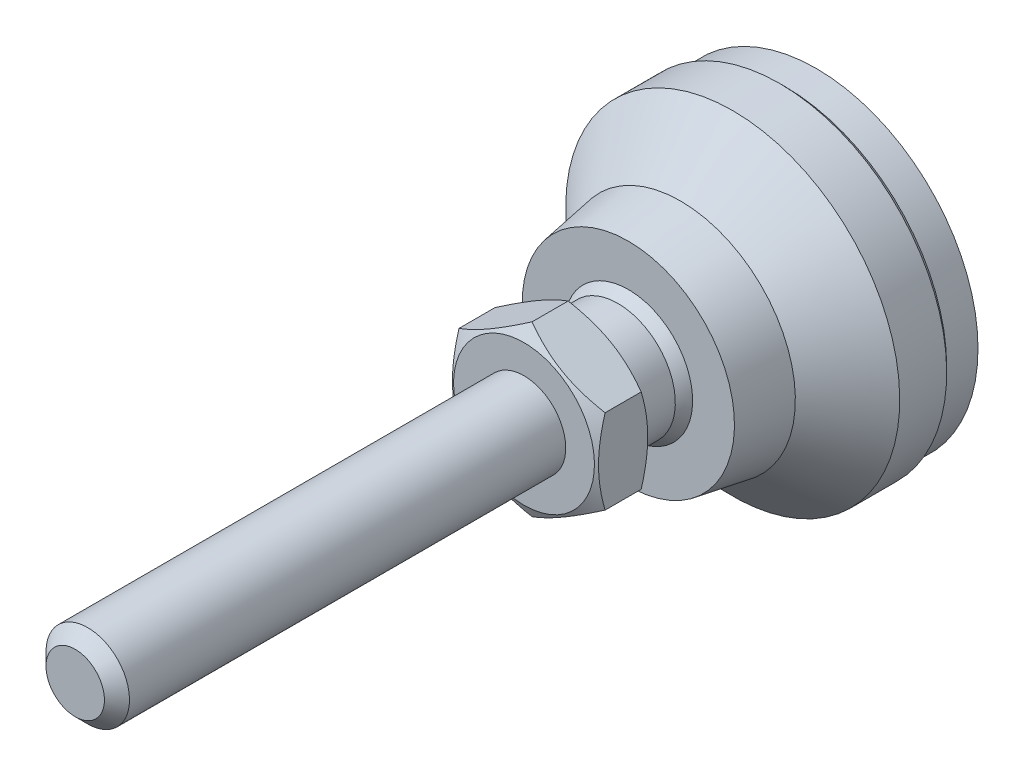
ISO-10303-21;
HEADER;
FILE_DESCRIPTION(('STEP AP214'),'2;1');
FILE_NAME('part.step','',(''),(''),'','','');
FILE_SCHEMA(('AUTOMOTIVE_DESIGN { 1 0 10303 214 1 1 1 1 }'));
ENDSEC;
DATA;
#1=APPLICATION_CONTEXT('core data for automotive mechanical design processes');
#2=APPLICATION_PROTOCOL_DEFINITION('international standard','automotive_design',2000,#1);
#3=PRODUCT_CONTEXT('',#1,'mechanical');
#4=PRODUCT('Part','Part','',(#3));
#5=PRODUCT_RELATED_PRODUCT_CATEGORY('part','',(#4));
#6=PRODUCT_DEFINITION_FORMATION('','',#4);
#7=PRODUCT_DEFINITION_CONTEXT('part definition',#1,'design');
#8=PRODUCT_DEFINITION('design','',#6,#7);
#9=PRODUCT_DEFINITION_SHAPE('','',#8);
#10=(LENGTH_UNIT() NAMED_UNIT(*) SI_UNIT(.MILLI.,.METRE.));
#11=(NAMED_UNIT(*) PLANE_ANGLE_UNIT() SI_UNIT($,.RADIAN.));
#12=(NAMED_UNIT(*) SI_UNIT($,.STERADIAN.) SOLID_ANGLE_UNIT());
#13=UNCERTAINTY_MEASURE_WITH_UNIT(LENGTH_MEASURE(1.E-05),#10,'distance_accuracy_value','');
#14=(GEOMETRIC_REPRESENTATION_CONTEXT(3) GLOBAL_UNCERTAINTY_ASSIGNED_CONTEXT((#13)) GLOBAL_UNIT_ASSIGNED_CONTEXT((#10,
#11,#12)) REPRESENTATION_CONTEXT('',''));
#15=CARTESIAN_POINT('',(0.,0.,0.));
#16=DIRECTION('',(0.,0.,1.));
#17=DIRECTION('',(1.,0.,0.));
#18=AXIS2_PLACEMENT_3D('',#15,#16,#17);
#19=CARTESIAN_POINT('',(0.,0.,2.99999999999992));
#20=DIRECTION('',(0.,0.,-1.));
#21=DIRECTION('',(0.,1.,0.));
#22=AXIS2_PLACEMENT_3D('',#19,#20,#21);
#23=CYLINDRICAL_SURFACE('',#22,5.49999999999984);
#24=CARTESIAN_POINT('',(0.,0.,23.));
#25=DIRECTION('',(0.,0.,-1.));
#26=DIRECTION('',(0.,1.,0.));
#27=AXIS2_PLACEMENT_3D('',#24,#25,#26);
#28=CIRCLE('',#27,5.49999999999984);
#29=CARTESIAN_POINT('',(0.,5.49999999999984,23.));
#30=VERTEX_POINT('',#29);
#31=EDGE_CURVE('E111',#30,#30,#28,.T.);
#32=ORIENTED_EDGE('',*,*,#31,.T.);
#33=EDGE_LOOP('',(#32));
#34=FACE_BOUND('',#33,.T.);
#35=CARTESIAN_POINT('',(0.,0.,19.));
#36=DIRECTION('',(0.,0.,1.));
#37=DIRECTION('',(0.,-1.,0.));
#38=AXIS2_PLACEMENT_3D('',#35,#36,#37);
#39=CIRCLE('',#38,5.49999999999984);
#40=CARTESIAN_POINT('',(-5.50000000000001,0.,19.));
#41=VERTEX_POINT('',#40);
#42=EDGE_CURVE('E113',#41,#41,#39,.T.);
#43=ORIENTED_EDGE('',*,*,#42,.T.);
#44=EDGE_LOOP('',(#43));
#45=FACE_BOUND('',#44,.T.);
#46=ADVANCED_FACE('F14',(#34,#45),#23,.T.);
#47=CARTESIAN_POINT('',(0.,0.,14.6698729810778));
#48=DIRECTION('',(0.,0.,1.));
#49=DIRECTION('',(-1.,0.,0.));
#50=AXIS2_PLACEMENT_3D('',#47,#48,#49);
#51=SPHERICAL_SURFACE('',#50,7.);
#52=CARTESIAN_POINT('',(0.,0.,18.));
#53=DIRECTION('',(0.,0.,1.));
#54=DIRECTION('',(0.,-1.,0.));
#55=AXIS2_PLACEMENT_3D('',#52,#53,#54);
#56=CIRCLE('',#55,6.15713034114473);
#57=CARTESIAN_POINT('',(-6.15713034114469,0.,18.));
#58=VERTEX_POINT('',#57);
#59=EDGE_CURVE('E118',#58,#58,#56,.T.);
#60=CARTESIAN_POINT('',(-5.50000000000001,0.,19.));
#61=CARTESIAN_POINT('',(-5.50771979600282,0.,18.9901945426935));
#62=CARTESIAN_POINT('',(-5.51541336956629,0.,18.9803684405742));
#63=CARTESIAN_POINT('',(-5.530747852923,0.,18.9606752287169));
#64=CARTESIAN_POINT('',(-5.53838876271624,0.,18.950808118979));
#65=CARTESIAN_POINT('',(-5.55361769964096,0.,18.9310331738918));
#66=CARTESIAN_POINT('',(-5.56120572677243,0.,18.9211253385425));
#67=CARTESIAN_POINT('',(-5.57632868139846,0.,18.901269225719));
#68=CARTESIAN_POINT('',(-5.58386360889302,0.,18.8913209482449));
#69=CARTESIAN_POINT('',(-5.59888014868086,0.,18.8713842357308));
#70=CARTESIAN_POINT('',(-5.60636176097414,0.,18.8613958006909));
#71=CARTESIAN_POINT('',(-5.62127145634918,0.,18.8413790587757));
#72=CARTESIAN_POINT('',(-5.62869953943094,0.,18.8313507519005));
#73=CARTESIAN_POINT('',(-5.64350196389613,0.,18.8112545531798));
#74=CARTESIAN_POINT('',(-5.65087630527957,0.,18.8011866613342));
#75=CARTESIAN_POINT('',(-5.66557103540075,0.,18.7810115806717));
#76=CARTESIAN_POINT('',(-5.67289142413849,0.,18.7709043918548));
#77=CARTESIAN_POINT('',(-5.68747803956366,0.,18.7506510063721));
#78=CARTESIAN_POINT('',(-5.69474426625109,0.,18.7405048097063));
#79=CARTESIAN_POINT('',(-5.70922234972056,0.,18.7201736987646));
#80=CARTESIAN_POINT('',(-5.7164342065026,0.,18.7099887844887));
#81=CARTESIAN_POINT('',(-5.73080334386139,0.,18.6895805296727));
#82=CARTESIAN_POINT('',(-5.73796062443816,0.,18.6793571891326));
#83=CARTESIAN_POINT('',(-5.75222040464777,0.,18.6588723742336));
#84=CARTESIAN_POINT('',(-5.75932290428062,0.,18.6486108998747));
#85=CARTESIAN_POINT('',(-5.77347291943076,0.,18.6280501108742));
#86=CARTESIAN_POINT('',(-5.78052043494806,0.,18.6177507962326));
#87=CARTESIAN_POINT('',(-5.79456028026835,0.,18.5971146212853));
#88=CARTESIAN_POINT('',(-5.80155261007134,0.,18.5867777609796));
#89=CARTESIAN_POINT('',(-5.81548188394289,0.,18.5660667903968));
#90=CARTESIAN_POINT('',(-5.82241882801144,0.,18.5556926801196));
#91=CARTESIAN_POINT('',(-5.8362371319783,0.,18.5349075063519));
#92=CARTESIAN_POINT('',(-5.84311849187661,0.,18.5244964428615));
#93=CARTESIAN_POINT('',(-5.85682543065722,0.,18.5036376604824));
#94=CARTESIAN_POINT('',(-5.86365100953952,0.,18.4931899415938));
#95=CARTESIAN_POINT('',(-5.87724619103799,0.,18.4722581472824));
#96=CARTESIAN_POINT('',(-5.88401579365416,0.,18.4617740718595));
#97=CARTESIAN_POINT('',(-5.89749882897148,0.,18.4407698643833));
#98=CARTESIAN_POINT('',(-5.90421226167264,0.,18.43024973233));
#99=CARTESIAN_POINT('',(-5.91758276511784,0.,18.409173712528));
#100=CARTESIAN_POINT('',(-5.92423983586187,0.,18.3986178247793));
#101=CARTESIAN_POINT('',(-5.93749742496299,0.,18.3774705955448));
#102=CARTESIAN_POINT('',(-5.94409794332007,0.,18.3668792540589));
#103=CARTESIAN_POINT('',(-5.95724223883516,0.,18.345661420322));
#104=CARTESIAN_POINT('',(-5.96378601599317,0.,18.3350349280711));
#105=CARTESIAN_POINT('',(-5.97681664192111,0.,18.3137470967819));
#106=CARTESIAN_POINT('',(-5.98330349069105,0.,18.3030857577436));
#107=CARTESIAN_POINT('',(-5.99622007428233,0.,18.2817285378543));
#108=CARTESIAN_POINT('',(-6.00264980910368,0.,18.2710326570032));
#109=CARTESIAN_POINT('',(-6.015451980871,0.,18.2496066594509));
#110=CARTESIAN_POINT('',(-6.02182441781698,0.,18.2388765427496));
#111=CARTESIAN_POINT('',(-6.034511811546,0.,18.2173823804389));
#112=CARTESIAN_POINT('',(-6.04082676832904,0.,18.2066183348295));
#113=CARTESIAN_POINT('',(-6.05339902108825,0.,18.1850566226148));
#114=CARTESIAN_POINT('',(-6.05965631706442,0.,18.1742589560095));
#115=CARTESIAN_POINT('',(-6.07211306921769,0.,18.1526303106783));
#116=CARTESIAN_POINT('',(-6.0783125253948,0.,18.1417993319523));
#117=CARTESIAN_POINT('',(-6.09065342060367,0.,18.1201043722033));
#118=CARTESIAN_POINT('',(-6.09679485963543,0.,18.1092403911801));
#119=CARTESIAN_POINT('',(-6.10901954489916,0.,18.0874797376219));
#120=CARTESIAN_POINT('',(-6.11510279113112,0.,18.0765830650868));
#121=CARTESIAN_POINT('',(-6.12721091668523,0.,18.0547573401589));
#122=CARTESIAN_POINT('',(-6.13323579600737,0.,18.0438282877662));
#123=CARTESIAN_POINT('',(-6.14522701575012,0.,18.0219381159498));
#124=CARTESIAN_POINT('',(-6.15119335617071,0.,18.010976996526));
#125=CARTESIAN_POINT('',(-6.15713034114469,0.,18.));
#126=B_SPLINE_CURVE_WITH_KNOTS('',3,(#60,#61,#62,#63,#64,#65,#66,#67,#68,#69,#70,#71,#72,#73,
#74,#75,#76,#77,#78,#79,#80,#81,#82,#83,#84,#85,#86,#87,#88,#89,#90,#91,#92,#93,#94,#95,#96,#97,
#98,#99,#100,#101,#102,#103,#104,#105,#106,#107,#108,#109,#110,#111,#112,#113,#114,#115,#116,
#117,#118,#119,#120,#121,#122,#123,#124,#125),.UNSPECIFIED.,.F.,.F.,(4,2,2,2,2,2,2,2,2,2,2,2,2,
2,2,2,2,2,2,2,2,2,2,2,2,2,2,2,2,2,2,2,4),(0.,0.0374389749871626,0.0748779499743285,
0.112316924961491,0.149755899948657,0.18719487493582,0.224633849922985,0.262072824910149,
0.299511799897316,0.336950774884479,0.374389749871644,0.411828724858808,0.449267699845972,
0.486706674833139,0.524145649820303,0.561584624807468,0.599023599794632,0.636462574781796,
0.673901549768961,0.711340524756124,0.74877949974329,0.786218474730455,0.823657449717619,
0.861096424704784,0.898535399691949,0.935974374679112,0.973413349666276,1.01085232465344,
1.04829129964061,1.08573027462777,1.12316924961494,1.1606082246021,1.19804719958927),.UNSPECIFIED.);
#127=EDGE_CURVE('BSEAM157',#41,#58,#126,.T.);
#128=ORIENTED_EDGE('',*,*,#42,.F.);
#129=ORIENTED_EDGE('',*,*,#59,.T.);
#130=ORIENTED_EDGE('',*,*,#127,.T.);
#131=ORIENTED_EDGE('',*,*,#127,.F.);
#132=EDGE_LOOP('',(#128,#130,#129,#131));
#133=FACE_BOUND('',#132,.T.);
#134=ADVANCED_FACE('F157',(#133),#51,.T.);
#135=CARTESIAN_POINT('',(0.,0.,3.5));
#136=DIRECTION('',(0.,0.,1.));
#137=DIRECTION('',(0.,-1.,0.));
#138=AXIS2_PLACEMENT_3D('',#135,#136,#137);
#139=CONICAL_SURFACE('',#138,16.,0.785398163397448);
#140=CARTESIAN_POINT('',(0.,0.,3.));
#141=DIRECTION('',(0.,0.,-1.));
#142=DIRECTION('',(0.,1.,0.));
#143=AXIS2_PLACEMENT_3D('',#140,#141,#142);
#144=CIRCLE('',#143,15.5);
#145=CARTESIAN_POINT('',(0.,15.5,3.));
#146=VERTEX_POINT('',#145);
#147=EDGE_CURVE('E87',#146,#146,#144,.T.);
#148=ORIENTED_EDGE('',*,*,#147,.F.);
#149=EDGE_LOOP('',(#148));
#150=FACE_BOUND('',#149,.T.);
#151=CARTESIAN_POINT('',(0.,0.,3.5));
#152=DIRECTION('',(0.,0.,-1.));
#153=DIRECTION('',(0.,1.,0.));
#154=AXIS2_PLACEMENT_3D('',#151,#152,#153);
#155=CIRCLE('',#154,16.);
#156=CARTESIAN_POINT('',(0.,16.,3.5));
#157=VERTEX_POINT('',#156);
#158=EDGE_CURVE('E90',#157,#157,#155,.T.);
#159=ORIENTED_EDGE('',*,*,#158,.T.);
#160=EDGE_LOOP('',(#159));
#161=FACE_BOUND('',#160,.T.);
#162=ADVANCED_FACE('F162',(#150,#161),#139,.T.);
#163=CARTESIAN_POINT('',(0.,0.,2.99999999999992));
#164=DIRECTION('',(0.,0.,-1.));
#165=DIRECTION('',(0.,1.,0.));
#166=AXIS2_PLACEMENT_3D('',#163,#164,#165);
#167=CYLINDRICAL_SURFACE('',#166,16.);
#168=ORIENTED_EDGE('',*,*,#158,.F.);
#169=EDGE_LOOP('',(#168));
#170=FACE_BOUND('',#169,.T.);
#171=CARTESIAN_POINT('',(0.,0.,8.));
#172=DIRECTION('',(0.,0.,-1.));
#173=DIRECTION('',(0.,1.,0.));
#174=AXIS2_PLACEMENT_3D('',#171,#172,#173);
#175=CIRCLE('',#174,16.);
#176=CARTESIAN_POINT('',(0.,16.,8.));
#177=VERTEX_POINT('',#176);
#178=EDGE_CURVE('E107',#177,#177,#175,.T.);
#179=ORIENTED_EDGE('',*,*,#178,.T.);
#180=EDGE_LOOP('',(#179));
#181=FACE_BOUND('',#180,.T.);
#182=ADVANCED_FACE('F168',(#170,#181),#167,.T.);
#183=CARTESIAN_POINT('',(0.,0.,13.));
#184=DIRECTION('',(0.,0.,-1.));
#185=DIRECTION('',(0.,1.,0.));
#186=AXIS2_PLACEMENT_3D('',#183,#184,#185);
#187=CONICAL_SURFACE('',#186,11.,0.785398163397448);
#188=ORIENTED_EDGE('',*,*,#178,.F.);
#189=EDGE_LOOP('',(#188));
#190=FACE_BOUND('',#189,.T.);
#191=CARTESIAN_POINT('',(0.,0.,13.));
#192=DIRECTION('',(0.,0.,-1.));
#193=DIRECTION('',(0.,1.,0.));
#194=AXIS2_PLACEMENT_3D('',#191,#192,#193);
#195=CIRCLE('',#194,11.);
#196=CARTESIAN_POINT('',(0.,11.,13.));
#197=VERTEX_POINT('',#196);
#198=EDGE_CURVE('E28',#197,#197,#195,.T.);
#199=ORIENTED_EDGE('',*,*,#198,.T.);
#200=EDGE_LOOP('',(#199));
#201=FACE_BOUND('',#200,.T.);
#202=ADVANCED_FACE('F151',(#190,#201),#187,.T.);
#203=CARTESIAN_POINT('',(0.,0.,19.));
#204=DIRECTION('',(0.,0.,-1.));
#205=DIRECTION('',(0.,1.,0.));
#206=AXIS2_PLACEMENT_3D('',#203,#204,#205);
#207=CONICAL_SURFACE('',#206,10.,0.165148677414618);
#208=ORIENTED_EDGE('',*,*,#198,.F.);
#209=EDGE_LOOP('',(#208));
#210=FACE_BOUND('',#209,.T.);
#211=CARTESIAN_POINT('',(0.,0.,18.));
#212=DIRECTION('',(0.,0.,-1.));
#213=DIRECTION('',(0.,1.,0.));
#214=AXIS2_PLACEMENT_3D('',#211,#212,#213);
#215=CIRCLE('',#214,10.1666666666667);
#216=CARTESIAN_POINT('',(0.,10.1666666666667,18.));
#217=VERTEX_POINT('',#216);
#218=EDGE_CURVE('E95',#217,#217,#215,.T.);
#219=ORIENTED_EDGE('',*,*,#218,.T.);
#220=EDGE_LOOP('',(#219));
#221=FACE_BOUND('',#220,.T.);
#222=ADVANCED_FACE('F135',(#210,#221),#207,.T.);
#223=CARTESIAN_POINT('',(-10.1666666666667,0.,18.));
#224=DIRECTION('',(0.,0.,1.));
#225=DIRECTION('',(0.,-1.,0.));
#226=AXIS2_PLACEMENT_3D('',#223,#224,#225);
#227=PLANE('',#226);
#228=ORIENTED_EDGE('',*,*,#218,.F.);
#229=EDGE_LOOP('',(#228));
#230=FACE_BOUND('',#229,.T.);
#231=ORIENTED_EDGE('',*,*,#59,.F.);
#232=EDGE_LOOP('',(#231));
#233=FACE_BOUND('',#232,.T.);
#234=ADVANCED_FACE('F137',(#230,#233),#227,.T.);
#235=CARTESIAN_POINT('',(0.,-8.08290376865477,23.));
#236=DIRECTION('',(0.,0.,-1.));
#237=DIRECTION('',(0.,1.,0.));
#238=AXIS2_PLACEMENT_3D('',#235,#236,#237);
#239=PLANE('',#238);
#240=CARTESIAN_POINT('',(0.,0.,23.));
#241=DIRECTION('',(0.,0.,1.));
#242=DIRECTION('',(0.,-1.,0.));
#243=AXIS2_PLACEMENT_3D('',#240,#241,#242);
#244=CIRCLE('',#243,6.75);
#245=CARTESIAN_POINT('',(0.,-6.75,23.));
#246=VERTEX_POINT('',#245);
#247=EDGE_CURVE('E81',#246,#246,#244,.T.);
#248=ORIENTED_EDGE('',*,*,#247,.F.);
#249=EDGE_LOOP('',(#248));
#250=FACE_BOUND('',#249,.T.);
#251=ORIENTED_EDGE('',*,*,#31,.F.);
#252=EDGE_LOOP('',(#251));
#253=FACE_BOUND('',#252,.T.);
#254=ADVANCED_FACE('F140',(#250,#253),#239,.T.);
#255=CARTESIAN_POINT('',(0.,0.,10.4664031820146));
#256=DIRECTION('',(0.,0.,1.));
#257=DIRECTION('',(0.,-1.,0.));
#258=AXIS2_PLACEMENT_3D('',#255,#256,#257);
#259=CYLINDRICAL_SURFACE('',#258,15.5);
#260=CARTESIAN_POINT('',(0.,0.,0.));
#261=DIRECTION('',(0.,0.,1.));
#262=DIRECTION('',(0.,-1.,0.));
#263=AXIS2_PLACEMENT_3D('',#260,#261,#262);
#264=CIRCLE('',#263,15.5);
#265=CARTESIAN_POINT('',(0.,-15.5,0.));
#266=VERTEX_POINT('',#265);
#267=EDGE_CURVE('E293',#266,#266,#264,.T.);
#268=ORIENTED_EDGE('',*,*,#267,.T.);
#269=EDGE_LOOP('',(#268));
#270=FACE_BOUND('',#269,.T.);
#271=ORIENTED_EDGE('',*,*,#147,.T.);
#272=EDGE_LOOP('',(#271));
#273=FACE_BOUND('',#272,.T.);
#274=ADVANCED_FACE('F148',(#270,#273),#259,.T.);
#275=CARTESIAN_POINT('',(0.,-15.5,0.));
#276=DIRECTION('',(0.,0.,-1.));
#277=DIRECTION('',(0.,1.,0.));
#278=AXIS2_PLACEMENT_3D('',#275,#276,#277);
#279=PLANE('',#278);
#280=ORIENTED_EDGE('',*,*,#267,.F.);
#281=EDGE_LOOP('',(#280));
#282=FACE_BOUND('',#281,.T.);
#283=ADVANCED_FACE('F205',(#282),#279,.T.);
#284=CARTESIAN_POINT('',(0.,0.,23.));
#285=DIRECTION('',(0.,0.,1.));
#286=DIRECTION('',(0.,-1.,0.));
#287=AXIS2_PLACEMENT_3D('',#284,#285,#286);
#288=CONICAL_SURFACE('',#287,6.75,1.0471975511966);
#289=CARTESIAN_POINT('',(7.0002,-4.04133641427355,23.7696190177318));
#290=CARTESIAN_POINT('',(6.8463320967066,-4.13017208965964,23.7183374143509));
#291=CARTESIAN_POINT('',(6.69189049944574,-4.21933898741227,23.669383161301));
#292=CARTESIAN_POINT('',(6.38175307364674,-4.39839691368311,23.5767703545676));
#293=CARTESIAN_POINT('',(6.22605673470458,-4.4882882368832,23.5331140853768));
#294=CARTESIAN_POINT('',(5.75647483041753,-4.75940147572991,23.4109491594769));
#295=CARTESIAN_POINT('',(5.44073566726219,-4.94169356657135,23.3414631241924));
#296=CARTESIAN_POINT('',(4.96823775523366,-5.21449036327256,23.2599825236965));
#297=CARTESIAN_POINT('',(4.8128907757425,-5.30417998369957,23.2367710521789));
#298=CARTESIAN_POINT('',(4.50149488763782,-5.48396448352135,23.1978487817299));
#299=CARTESIAN_POINT('',(4.34544604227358,-5.57405932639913,23.1821373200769));
#300=CARTESIAN_POINT('',(4.03307732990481,-5.75440548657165,23.1586154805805));
#301=CARTESIAN_POINT('',(3.87675797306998,-5.84465650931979,23.1507961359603));
#302=CARTESIAN_POINT('',(3.56398349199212,-6.02523694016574,23.1432178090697));
#303=CARTESIAN_POINT('',(3.40752837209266,-6.11556634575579,23.1434585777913));
#304=CARTESIAN_POINT('',(2.97889312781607,-6.36303901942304,23.1551972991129));
#305=CARTESIAN_POINT('',(2.70685331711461,-6.52010127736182,23.1749033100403));
#306=CARTESIAN_POINT('',(2.16458055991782,-6.83318259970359,23.2373910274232));
#307=CARTESIAN_POINT('',(1.89434952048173,-6.98920056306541,23.2801940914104));
#308=CARTESIAN_POINT('',(1.35098545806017,-7.30291195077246,23.3871892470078));
#309=CARTESIAN_POINT('',(1.07792099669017,-7.46056579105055,23.4518346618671));
#310=CARTESIAN_POINT('',(0.53586421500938,-7.77352241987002,23.5985536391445));
#311=CARTESIAN_POINT('',(0.266864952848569,-7.92882921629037,23.680592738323));
#312=CARTESIAN_POINT('',(-0.00019999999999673,-8.08301923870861,23.7696190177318));
#313=B_SPLINE_CURVE_WITH_KNOTS('',3,(#289,#290,#291,#292,#293,#294,#295,#296,#297,#298,#299,
#300,#301,#302,#303,#304,#305,#306,#307,#308,#309,#310,#311,#312),.UNSPECIFIED.,.F.,.F.,(4,2,2,
2,2,2,2,2,2,2,2,4),(0.,0.554727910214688,1.10969417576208,2.2219327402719,2.76443041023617,
3.30688013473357,3.84871284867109,4.39052882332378,5.33376515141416,6.27787517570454,
7.24292418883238,8.20607866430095),.UNSPECIFIED.);
#314=CARTESIAN_POINT('',(7.,-4.04145188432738,23.7695523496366));
#315=VERTEX_POINT('',#314);
#316=CARTESIAN_POINT('',(0.,-8.08290376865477,23.7695523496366));
#317=VERTEX_POINT('',#316);
#318=EDGE_CURVE('E34',#315,#317,#313,.T.);
#319=ORIENTED_EDGE('',*,*,#318,.T.);
#320=CARTESIAN_POINT('',(0.000200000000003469,-8.0830192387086,23.7696190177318));
#321=CARTESIAN_POINT('',(-0.153667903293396,-7.99418356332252,23.7183374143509));
#322=CARTESIAN_POINT('',(-0.308109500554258,-7.90501666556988,23.669383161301));
#323=CARTESIAN_POINT('',(-0.618246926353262,-7.72595873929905,23.5767703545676));
#324=CARTESIAN_POINT('',(-0.77394326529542,-7.63606741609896,23.5331140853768));
#325=CARTESIAN_POINT('',(-1.24352516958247,-7.36495417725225,23.4109491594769));
#326=CARTESIAN_POINT('',(-1.55926433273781,-7.18266208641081,23.3414631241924));
#327=CARTESIAN_POINT('',(-2.03176224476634,-6.9098652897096,23.2599825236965));
#328=CARTESIAN_POINT('',(-2.1871092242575,-6.82017566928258,23.2367710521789));
#329=CARTESIAN_POINT('',(-2.49850511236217,-6.64039116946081,23.1978487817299));
#330=CARTESIAN_POINT('',(-2.65455395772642,-6.55029632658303,23.1821373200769));
#331=CARTESIAN_POINT('',(-2.96692267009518,-6.36995016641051,23.1586154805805));
#332=CARTESIAN_POINT('',(-3.12324202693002,-6.27969914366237,23.1507961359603));
#333=CARTESIAN_POINT('',(-3.43601650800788,-6.09911871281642,23.1432178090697));
#334=CARTESIAN_POINT('',(-3.59247162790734,-6.00878930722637,23.1434585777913));
#335=CARTESIAN_POINT('',(-4.02110687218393,-5.76131663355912,23.1551972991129));
#336=CARTESIAN_POINT('',(-4.29314668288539,-5.60425437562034,23.1749033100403));
#337=CARTESIAN_POINT('',(-4.83541944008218,-5.29117305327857,23.2373910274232));
#338=CARTESIAN_POINT('',(-5.10565047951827,-5.13515508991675,23.2801940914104));
#339=CARTESIAN_POINT('',(-5.64901454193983,-4.8214437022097,23.3871892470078));
#340=CARTESIAN_POINT('',(-5.92207900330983,-4.6637898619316,23.4518346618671));
#341=CARTESIAN_POINT('',(-6.46413578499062,-4.35083323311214,23.5985536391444));
#342=CARTESIAN_POINT('',(-6.73313504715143,-4.19552643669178,23.680592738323));
#343=CARTESIAN_POINT('',(-7.0002,-4.04133641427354,23.7696190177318));
#344=B_SPLINE_CURVE_WITH_KNOTS('',3,(#320,#321,#322,#323,#324,#325,#326,#327,#328,#329,#330,
#331,#332,#333,#334,#335,#336,#337,#338,#339,#340,#341,#342,#343),.UNSPECIFIED.,.F.,.F.,(4,2,2,
2,2,2,2,2,2,2,2,4),(0.,0.554727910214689,1.10969417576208,2.2219327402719,2.76443041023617,
3.30688013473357,3.84871284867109,4.39052882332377,5.33376515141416,6.27787517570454,
7.24292418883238,8.20607866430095),.UNSPECIFIED.);
#345=CARTESIAN_POINT('',(-7.,-4.04145188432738,23.7695523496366));
#346=VERTEX_POINT('',#345);
#347=EDGE_CURVE('E9',#317,#346,#344,.T.);
#348=ORIENTED_EDGE('',*,*,#347,.T.);
#349=CARTESIAN_POINT('',(-7.,10.8708854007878,26.5678292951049));
#350=CARTESIAN_POINT('',(-7.,10.5650221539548,26.4193977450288));
#351=CARTESIAN_POINT('',(-7.,10.2584583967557,26.2723850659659));
#352=CARTESIAN_POINT('',(-7.,9.64355737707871,25.9819951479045));
#353=CARTESIAN_POINT('',(-7.,9.33521984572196,25.8386184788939));
#354=CARTESIAN_POINT('',(-7.,8.71481738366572,25.5555801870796));
#355=CARTESIAN_POINT('',(-7.,8.4027413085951,25.4159429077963));
#356=CARTESIAN_POINT('',(-7.,7.77611232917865,25.142362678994));
#357=CARTESIAN_POINT('',(-7.,7.46155954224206,25.0084194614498));
#358=CARTESIAN_POINT('',(-7.,6.81926669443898,24.7435193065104));
#359=CARTESIAN_POINT('',(-7.,6.49142874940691,24.6127983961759));
#360=CARTESIAN_POINT('',(-7.,5.83192373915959,24.3612135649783));
#361=CARTESIAN_POINT('',(-7.,5.50025624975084,24.2403507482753));
#362=CARTESIAN_POINT('',(-7.,4.8331763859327,24.0116442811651));
#363=CARTESIAN_POINT('',(-7.,4.49777309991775,23.9037744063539));
#364=CARTESIAN_POINT('',(-7.,3.82216729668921,23.7045038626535));
#365=CARTESIAN_POINT('',(-7.,3.48196632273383,23.6130980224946));
#366=CARTESIAN_POINT('',(-7.,2.79840636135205,23.451625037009));
#367=CARTESIAN_POINT('',(-7.,2.4550755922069,23.3814416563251));
#368=CARTESIAN_POINT('',(-7.,1.93694051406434,23.2951141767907));
#369=CARTESIAN_POINT('',(-7.,1.76369286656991,23.2694951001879));
#370=CARTESIAN_POINT('',(-7.,1.41633211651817,23.2250751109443));
#371=CARTESIAN_POINT('',(-7.,1.24221910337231,23.206273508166));
#372=CARTESIAN_POINT('',(-7.,0.895641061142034,23.1760994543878));
#373=CARTESIAN_POINT('',(-7.,0.723184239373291,23.1646331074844));
#374=CARTESIAN_POINT('',(-7.,0.377940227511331,23.149004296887));
#375=CARTESIAN_POINT('',(-7.,0.205153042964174,23.1448417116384));
#376=CARTESIAN_POINT('',(-7.,-0.140442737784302,23.1439197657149));
#377=CARTESIAN_POINT('',(-7.,-0.313251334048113,23.147160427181));
#378=CARTESIAN_POINT('',(-7.,-0.658577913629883,23.1609655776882));
#379=CARTESIAN_POINT('',(-7.,-0.831095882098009,23.1715304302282));
#380=CARTESIAN_POINT('',(-7.,-1.24524861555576,23.2054604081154));
#381=CARTESIAN_POINT('',(-7.,-1.48660677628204,23.2322750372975));
#382=CARTESIAN_POINT('',(-7.,-1.96753031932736,23.2987803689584));
#383=CARTESIAN_POINT('',(-7.,-2.2070954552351,23.3384728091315));
#384=CARTESIAN_POINT('',(-7.,-2.92282804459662,23.4747620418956));
#385=CARTESIAN_POINT('',(-7.,-3.39576595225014,23.5885460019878));
#386=CARTESIAN_POINT('',(-7.,-4.1029590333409,23.7858465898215));
#387=CARTESIAN_POINT('',(-7.,-4.34088249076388,23.8569709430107));
#388=CARTESIAN_POINT('',(-7.,-4.81441852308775,24.0066044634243));
#389=CARTESIAN_POINT('',(-7.,-5.05003108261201,24.0851136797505));
#390=CARTESIAN_POINT('',(-7.,-5.51901951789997,24.2482574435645));
#391=CARTESIAN_POINT('',(-7.,-5.75239610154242,24.3328899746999));
#392=CARTESIAN_POINT('',(-7.,-6.21721575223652,24.5072848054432));
#393=CARTESIAN_POINT('',(-7.,-6.44865884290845,24.5970470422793));
#394=CARTESIAN_POINT('',(-7.,-6.99873724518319,24.8162854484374));
#395=CARTESIAN_POINT('',(-7.,-7.31658643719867,24.9477304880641));
#396=CARTESIAN_POINT('',(-7.,-7.94955004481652,25.2170670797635));
#397=CARTESIAN_POINT('',(-7.,-8.26466428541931,25.3549590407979));
#398=CARTESIAN_POINT('',(-7.,-8.8926670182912,25.6358819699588));
#399=CARTESIAN_POINT('',(-7.,-9.20555502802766,25.7789140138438));
#400=CARTESIAN_POINT('',(-7.,-9.82942760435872,26.0690781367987));
#401=CARTESIAN_POINT('',(-7.,-10.1404121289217,26.2162103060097));
#402=CARTESIAN_POINT('',(-7.,-10.7611271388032,26.5139582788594));
#403=CARTESIAN_POINT('',(-7.,-11.0708558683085,26.6645777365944));
#404=CARTESIAN_POINT('',(-7.,-11.6889716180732,26.9685475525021));
#405=CARTESIAN_POINT('',(-7.,-11.9973586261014,27.1218979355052));
#406=CARTESIAN_POINT('',(-7.,-12.9207454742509,27.5852702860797));
#407=CARTESIAN_POINT('',(-7.,-13.5340574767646,27.8986552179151));
#408=CARTESIAN_POINT('',(-7.,-14.7053562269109,28.504770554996));
#409=CARTESIAN_POINT('',(-7.,-15.2636091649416,28.796988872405));
#410=CARTESIAN_POINT('',(-7.,-16.378047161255,29.385388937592));
#411=CARTESIAN_POINT('',(-7.,-16.9342321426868,29.6815708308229));
#412=CARTESIAN_POINT('',(-7.,-18.0435736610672,30.2761881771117));
#413=CARTESIAN_POINT('',(-7.,-18.5967343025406,30.574615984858));
#414=CARTESIAN_POINT('',(-7.,-19.7017359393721,31.1738316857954));
#415=CARTESIAN_POINT('',(-7.,-20.2535770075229,31.4746194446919));
#416=CARTESIAN_POINT('',(-7.,-20.8049337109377,31.7762865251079));
#417=B_SPLINE_CURVE_WITH_KNOTS('',3,(#349,#350,#351,#352,#353,#354,#355,#356,#357,#358,#359,
#360,#361,#362,#363,#364,#365,#366,#367,#368,#369,#370,#371,#372,#373,#374,#375,#376,#377,#378,
#379,#380,#381,#382,#383,#384,#385,#386,#387,#388,#389,#390,#391,#392,#393,#394,#395,#396,#397,
#398,#399,#400,#401,#402,#403,#404,#405,#406,#407,#408,#409,#410,#411,#412,#413,#414,#415,#416),
.UNSPECIFIED.,.F.,.F.,(4,2,2,2,2,2,2,2,2,2,2,2,2,2,2,2,2,2,2,2,2,2,2,2,2,2,2,2,2,2,2,2,2,4),(0.,
1.01994289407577,2.04004470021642,3.06567469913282,4.09125636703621,5.1499492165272,
6.20876048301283,7.26539754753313,8.32170214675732,9.37211196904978,9.89739381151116,
10.4226224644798,10.9409857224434,11.459340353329,11.977696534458,12.4960784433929,
13.2241967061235,13.9524132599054,15.4096463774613,16.1545648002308,16.8994881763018,
17.6441673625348,18.3888374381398,19.4206096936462,20.4524474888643,21.4845025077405,
22.5165802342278,23.5497932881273,24.5830157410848,26.6491729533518,28.539484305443,
30.4298652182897,32.3154393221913,34.2009068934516),.UNSPECIFIED.);
#418=CARTESIAN_POINT('',(-7.,4.04145188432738,23.7695523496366));
#419=VERTEX_POINT('',#418);
#420=EDGE_CURVE('E73',#346,#419,#417,.F.);
#421=ORIENTED_EDGE('',*,*,#420,.T.);
#422=CARTESIAN_POINT('',(-7.0002,4.04133641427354,23.7696190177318));
#423=CARTESIAN_POINT('',(-6.8463320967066,4.13017208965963,23.7183374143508));
#424=CARTESIAN_POINT('',(-6.69189049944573,4.21933898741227,23.669383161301));
#425=CARTESIAN_POINT('',(-6.38175307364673,4.3983969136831,23.5767703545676));
#426=CARTESIAN_POINT('',(-6.22605673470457,4.48828823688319,23.5331140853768));
#427=CARTESIAN_POINT('',(-5.75647483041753,4.75940147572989,23.4109491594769));
#428=CARTESIAN_POINT('',(-5.44073566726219,4.94169356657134,23.3414631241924));
#429=CARTESIAN_POINT('',(-4.96823775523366,5.21449036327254,23.2599825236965));
#430=CARTESIAN_POINT('',(-4.8128907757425,5.30417998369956,23.2367710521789));
#431=CARTESIAN_POINT('',(-4.50149488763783,5.48396448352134,23.1978487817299));
#432=CARTESIAN_POINT('',(-4.34544604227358,5.57405932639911,23.1821373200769));
#433=CARTESIAN_POINT('',(-4.03307732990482,5.75440548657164,23.1586154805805));
#434=CARTESIAN_POINT('',(-3.87675797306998,5.84465650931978,23.1507961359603));
#435=CARTESIAN_POINT('',(-3.56398349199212,6.02523694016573,23.1432178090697));
#436=CARTESIAN_POINT('',(-3.40752837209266,6.11556634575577,23.1434585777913));
#437=CARTESIAN_POINT('',(-2.97889312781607,6.36303901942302,23.1551972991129));
#438=CARTESIAN_POINT('',(-2.70685331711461,6.52010127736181,23.1749033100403));
#439=CARTESIAN_POINT('',(-2.16458055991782,6.83318259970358,23.2373910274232));
#440=CARTESIAN_POINT('',(-1.89434952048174,6.98920056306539,23.2801940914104));
#441=CARTESIAN_POINT('',(-1.35098545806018,7.30291195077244,23.3871892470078));
#442=CARTESIAN_POINT('',(-1.07792099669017,7.46056579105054,23.4518346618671));
#443=CARTESIAN_POINT('',(-0.535864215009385,7.77352241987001,23.5985536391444));
#444=CARTESIAN_POINT('',(-0.266864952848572,7.92882921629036,23.6805927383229));
#445=CARTESIAN_POINT('',(0.000199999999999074,8.0830192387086,23.7696190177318));
#446=B_SPLINE_CURVE_WITH_KNOTS('',3,(#422,#423,#424,#425,#426,#427,#428,#429,#430,#431,#432,
#433,#434,#435,#436,#437,#438,#439,#440,#441,#442,#443,#444,#445),.UNSPECIFIED.,.F.,.F.,(4,2,2,
2,2,2,2,2,2,2,2,4),(0.,0.554727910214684,1.10969417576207,2.22193274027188,2.76443041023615,
3.30688013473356,3.84871284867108,4.39052882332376,5.33376515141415,6.27787517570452,
7.24292418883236,8.20607866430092),.UNSPECIFIED.);
#447=CARTESIAN_POINT('',(0.,8.08290376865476,23.7695523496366));
#448=VERTEX_POINT('',#447);
#449=EDGE_CURVE('E80',#419,#448,#446,.T.);
#450=ORIENTED_EDGE('',*,*,#449,.T.);
#451=CARTESIAN_POINT('',(-0.000200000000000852,8.0830192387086,23.7696190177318));
#452=CARTESIAN_POINT('',(0.153667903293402,7.99418356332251,23.7183374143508));
#453=CARTESIAN_POINT('',(0.308109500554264,7.90501666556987,23.669383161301));
#454=CARTESIAN_POINT('',(0.618246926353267,7.72595873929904,23.5767703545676));
#455=CARTESIAN_POINT('',(0.773943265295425,7.63606741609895,23.5331140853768));
#456=CARTESIAN_POINT('',(1.24352516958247,7.36495417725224,23.4109491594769));
#457=CARTESIAN_POINT('',(1.55926433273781,7.1826620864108,23.3414631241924));
#458=CARTESIAN_POINT('',(2.03176224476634,6.90986528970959,23.2599825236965));
#459=CARTESIAN_POINT('',(2.1871092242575,6.82017566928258,23.2367710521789));
#460=CARTESIAN_POINT('',(2.49850511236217,6.6403911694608,23.1978487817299));
#461=CARTESIAN_POINT('',(2.65455395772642,6.55029632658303,23.1821373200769));
#462=CARTESIAN_POINT('',(2.96692267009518,6.3699501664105,23.1586154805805));
#463=CARTESIAN_POINT('',(3.12324202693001,6.27969914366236,23.1507961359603));
#464=CARTESIAN_POINT('',(3.43601650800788,6.09911871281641,23.1432178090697));
#465=CARTESIAN_POINT('',(3.59247162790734,6.00878930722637,23.1434585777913));
#466=CARTESIAN_POINT('',(4.02110687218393,5.76131663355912,23.1551972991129));
#467=CARTESIAN_POINT('',(4.29314668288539,5.60425437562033,23.1749033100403));
#468=CARTESIAN_POINT('',(4.83541944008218,5.29117305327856,23.2373910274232));
#469=CARTESIAN_POINT('',(5.10565047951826,5.13515508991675,23.2801940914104));
#470=CARTESIAN_POINT('',(5.64901454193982,4.82144370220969,23.3871892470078));
#471=CARTESIAN_POINT('',(5.92207900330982,4.6637898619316,23.4518346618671));
#472=CARTESIAN_POINT('',(6.46413578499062,4.35083323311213,23.5985536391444));
#473=CARTESIAN_POINT('',(6.73313504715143,4.19552643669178,23.6805927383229));
#474=CARTESIAN_POINT('',(7.0002,4.04133641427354,23.7696190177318));
#475=B_SPLINE_CURVE_WITH_KNOTS('',3,(#451,#452,#453,#454,#455,#456,#457,#458,#459,#460,#461,
#462,#463,#464,#465,#466,#467,#468,#469,#470,#471,#472,#473,#474),.UNSPECIFIED.,.F.,.F.,(4,2,2,
2,2,2,2,2,2,2,2,4),(0.,0.554727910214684,1.10969417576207,2.22193274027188,2.76443041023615,
3.30688013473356,3.84871284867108,4.39052882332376,5.33376515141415,6.27787517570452,
7.24292418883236,8.20607866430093),.UNSPECIFIED.);
#476=CARTESIAN_POINT('',(7.,4.04145188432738,23.7695523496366));
#477=VERTEX_POINT('',#476);
#478=EDGE_CURVE('E253',#448,#477,#475,.T.);
#479=ORIENTED_EDGE('',*,*,#478,.T.);
#480=CARTESIAN_POINT('',(7.,10.8708854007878,26.5678292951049));
#481=CARTESIAN_POINT('',(7.,10.5650221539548,26.4193977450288));
#482=CARTESIAN_POINT('',(7.,10.2584583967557,26.2723850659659));
#483=CARTESIAN_POINT('',(7.,9.64355737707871,25.9819951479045));
#484=CARTESIAN_POINT('',(7.,9.33521984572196,25.8386184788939));
#485=CARTESIAN_POINT('',(7.,8.71481738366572,25.5555801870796));
#486=CARTESIAN_POINT('',(7.,8.4027413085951,25.4159429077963));
#487=CARTESIAN_POINT('',(7.,7.77611232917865,25.142362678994));
#488=CARTESIAN_POINT('',(7.,7.46155954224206,25.0084194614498));
#489=CARTESIAN_POINT('',(7.,6.81926669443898,24.7435193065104));
#490=CARTESIAN_POINT('',(7.,6.49142874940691,24.6127983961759));
#491=CARTESIAN_POINT('',(7.,5.83192373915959,24.3612135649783));
#492=CARTESIAN_POINT('',(7.,5.50025624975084,24.2403507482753));
#493=CARTESIAN_POINT('',(7.,4.8331763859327,24.0116442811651));
#494=CARTESIAN_POINT('',(7.,4.49777309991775,23.9037744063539));
#495=CARTESIAN_POINT('',(7.,3.82216729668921,23.7045038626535));
#496=CARTESIAN_POINT('',(7.,3.48196632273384,23.6130980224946));
#497=CARTESIAN_POINT('',(7.,2.79840636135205,23.451625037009));
#498=CARTESIAN_POINT('',(7.,2.4550755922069,23.3814416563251));
#499=CARTESIAN_POINT('',(7.,1.93694051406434,23.2951141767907));
#500=CARTESIAN_POINT('',(7.,1.76369286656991,23.2694951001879));
#501=CARTESIAN_POINT('',(7.,1.41633211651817,23.2250751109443));
#502=CARTESIAN_POINT('',(7.,1.24221910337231,23.206273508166));
#503=CARTESIAN_POINT('',(7.,0.895641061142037,23.1760994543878));
#504=CARTESIAN_POINT('',(7.,0.723184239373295,23.1646331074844));
#505=CARTESIAN_POINT('',(7.,0.377940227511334,23.149004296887));
#506=CARTESIAN_POINT('',(7.,0.205153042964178,23.1448417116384));
#507=CARTESIAN_POINT('',(7.,-0.140442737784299,23.1439197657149));
#508=CARTESIAN_POINT('',(7.,-0.31325133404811,23.147160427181));
#509=CARTESIAN_POINT('',(7.,-0.658577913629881,23.1609655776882));
#510=CARTESIAN_POINT('',(7.,-0.831095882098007,23.1715304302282));
#511=CARTESIAN_POINT('',(7.,-1.24524861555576,23.2054604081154));
#512=CARTESIAN_POINT('',(7.,-1.48660677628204,23.2322750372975));
#513=CARTESIAN_POINT('',(7.,-1.96753031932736,23.2987803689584));
#514=CARTESIAN_POINT('',(7.,-2.2070954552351,23.3384728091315));
#515=CARTESIAN_POINT('',(7.,-2.92282804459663,23.4747620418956));
#516=CARTESIAN_POINT('',(7.,-3.39576595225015,23.5885460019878));
#517=CARTESIAN_POINT('',(7.,-4.1029590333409,23.7858465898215));
#518=CARTESIAN_POINT('',(7.,-4.34088249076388,23.8569709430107));
#519=CARTESIAN_POINT('',(7.,-4.81441852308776,24.0066044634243));
#520=CARTESIAN_POINT('',(7.,-5.05003108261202,24.0851136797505));
#521=CARTESIAN_POINT('',(7.,-5.51901951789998,24.2482574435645));
#522=CARTESIAN_POINT('',(7.,-5.75239610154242,24.3328899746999));
#523=CARTESIAN_POINT('',(7.,-6.21721575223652,24.5072848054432));
#524=CARTESIAN_POINT('',(7.,-6.44865884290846,24.5970470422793));
#525=CARTESIAN_POINT('',(7.,-6.9987372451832,24.8162854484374));
#526=CARTESIAN_POINT('',(7.,-7.31658643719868,24.9477304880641));
#527=CARTESIAN_POINT('',(7.,-7.94955004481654,25.2170670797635));
#528=CARTESIAN_POINT('',(7.,-8.26466428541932,25.3549590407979));
#529=CARTESIAN_POINT('',(7.,-8.89266701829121,25.6358819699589));
#530=CARTESIAN_POINT('',(7.,-9.20555502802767,25.7789140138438));
#531=CARTESIAN_POINT('',(7.,-9.82942760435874,26.0690781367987));
#532=CARTESIAN_POINT('',(7.,-10.1404121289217,26.2162103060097));
#533=CARTESIAN_POINT('',(7.,-10.7611271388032,26.5139582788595));
#534=CARTESIAN_POINT('',(7.,-11.0708558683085,26.6645777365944));
#535=CARTESIAN_POINT('',(7.,-11.6889716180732,26.9685475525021));
#536=CARTESIAN_POINT('',(7.,-11.9973586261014,27.1218979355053));
#537=CARTESIAN_POINT('',(7.,-12.9207454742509,27.5852702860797));
#538=CARTESIAN_POINT('',(7.,-13.5340574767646,27.8986552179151));
#539=CARTESIAN_POINT('',(7.,-14.7053562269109,28.5047705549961));
#540=CARTESIAN_POINT('',(7.,-15.2636091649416,28.796988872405));
#541=CARTESIAN_POINT('',(7.,-16.3780471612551,29.385388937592));
#542=CARTESIAN_POINT('',(7.,-16.9342321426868,29.6815708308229));
#543=CARTESIAN_POINT('',(7.,-18.0435736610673,30.2761881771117));
#544=CARTESIAN_POINT('',(7.,-18.5967343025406,30.5746159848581));
#545=CARTESIAN_POINT('',(7.,-19.7017359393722,31.1738316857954));
#546=CARTESIAN_POINT('',(7.,-20.253577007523,31.4746194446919));
#547=CARTESIAN_POINT('',(7.,-20.8049337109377,31.7762865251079));
#548=B_SPLINE_CURVE_WITH_KNOTS('',3,(#480,#481,#482,#483,#484,#485,#486,#487,#488,#489,#490,
#491,#492,#493,#494,#495,#496,#497,#498,#499,#500,#501,#502,#503,#504,#505,#506,#507,#508,#509,
#510,#511,#512,#513,#514,#515,#516,#517,#518,#519,#520,#521,#522,#523,#524,#525,#526,#527,#528,
#529,#530,#531,#532,#533,#534,#535,#536,#537,#538,#539,#540,#541,#542,#543,#544,#545,#546,#547),
.UNSPECIFIED.,.F.,.F.,(4,2,2,2,2,2,2,2,2,2,2,2,2,2,2,2,2,2,2,2,2,2,2,2,2,2,2,2,2,2,2,2,2,4),(0.,
1.01994289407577,2.04004470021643,3.06567469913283,4.09125636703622,5.1499492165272,
6.20876048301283,7.26539754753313,8.32170214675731,9.37211196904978,9.89739381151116,
10.4226224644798,10.9409857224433,11.459340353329,11.977696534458,12.4960784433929,
13.2241967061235,13.9524132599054,15.4096463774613,16.1545648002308,16.8994881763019,
17.6441673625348,18.3888374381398,19.4206096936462,20.4524474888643,21.4845025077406,
22.5165802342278,23.5497932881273,24.5830157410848,26.6491729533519,28.539484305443,
30.4298652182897,32.3154393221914,34.2009068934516),.UNSPECIFIED.);
#549=EDGE_CURVE('E247',#477,#315,#548,.T.);
#550=ORIENTED_EDGE('',*,*,#549,.T.);
#551=EDGE_LOOP('',(#319,#348,#421,#450,#479,#550));
#552=FACE_BOUND('',#551,.T.);
#553=ORIENTED_EDGE('',*,*,#247,.T.);
#554=EDGE_LOOP('',(#553));
#555=FACE_BOUND('',#554,.T.);
#556=ADVANCED_FACE('F71',(#552,#555),#288,.T.);
#557=CARTESIAN_POINT('',(0.,0.,71.));
#558=DIRECTION('',(0.,0.,-1.));
#559=DIRECTION('',(0.,1.,0.));
#560=AXIS2_PLACEMENT_3D('',#557,#558,#559);
#561=PLANE('',#560);
#562=CARTESIAN_POINT('',(0.,0.,71.));
#563=DIRECTION('',(0.,0.,1.));
#564=DIRECTION('',(0.,-1.,0.));
#565=AXIS2_PLACEMENT_3D('',#562,#563,#564);
#566=CIRCLE('',#565,2.79999999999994);
#567=CARTESIAN_POINT('',(0.,-2.79999999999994,71.));
#568=VERTEX_POINT('',#567);
#569=EDGE_CURVE('E121',#568,#568,#566,.T.);
#570=ORIENTED_EDGE('',*,*,#569,.T.);
#571=EDGE_LOOP('',(#570));
#572=FACE_BOUND('',#571,.T.);
#573=ADVANCED_FACE('F277',(#572),#561,.F.);
#574=CARTESIAN_POINT('',(0.,0.,69.8));
#575=DIRECTION('',(0.,0.,-1.));
#576=DIRECTION('',(0.,1.,0.));
#577=AXIS2_PLACEMENT_3D('',#574,#575,#576);
#578=CONICAL_SURFACE('',#577,3.99999999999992,0.785398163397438);
#579=ORIENTED_EDGE('',*,*,#569,.F.);
#580=EDGE_LOOP('',(#579));
#581=FACE_BOUND('',#580,.T.);
#582=CARTESIAN_POINT('',(0.,0.,69.8));
#583=DIRECTION('',(0.,0.,1.));
#584=DIRECTION('',(0.,-1.,0.));
#585=AXIS2_PLACEMENT_3D('',#582,#583,#584);
#586=CIRCLE('',#585,3.99999999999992);
#587=CARTESIAN_POINT('',(0.,-3.99999999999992,69.8));
#588=VERTEX_POINT('',#587);
#589=EDGE_CURVE('E126',#588,#588,#586,.T.);
#590=ORIENTED_EDGE('',*,*,#589,.T.);
#591=EDGE_LOOP('',(#590));
#592=FACE_BOUND('',#591,.T.);
#593=ADVANCED_FACE('F274',(#581,#592),#578,.T.);
#594=CARTESIAN_POINT('',(0.,0.,2.99999999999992));
#595=DIRECTION('',(0.,0.,-1.));
#596=DIRECTION('',(0.,1.,0.));
#597=AXIS2_PLACEMENT_3D('',#594,#595,#596);
#598=CYLINDRICAL_SURFACE('',#597,3.99999999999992);
#599=ORIENTED_EDGE('',*,*,#589,.F.);
#600=EDGE_LOOP('',(#599));
#601=FACE_BOUND('',#600,.T.);
#602=CARTESIAN_POINT('',(0.,0.,28.));
#603=DIRECTION('',(0.,0.,1.));
#604=DIRECTION('',(0.,-1.,0.));
#605=AXIS2_PLACEMENT_3D('',#602,#603,#604);
#606=CIRCLE('',#605,3.99999999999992);
#607=CARTESIAN_POINT('',(0.,-3.99999999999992,28.));
#608=VERTEX_POINT('',#607);
#609=EDGE_CURVE('E114',#608,#608,#606,.T.);
#610=ORIENTED_EDGE('',*,*,#609,.T.);
#611=EDGE_LOOP('',(#610));
#612=FACE_BOUND('',#611,.T.);
#613=ADVANCED_FACE('F16',(#601,#612),#598,.T.);
#614=CARTESIAN_POINT('',(-7.,12.1243556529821,28.));
#615=DIRECTION('',(0.,0.,-1.));
#616=DIRECTION('',(0.,1.,0.));
#617=AXIS2_PLACEMENT_3D('',#614,#615,#616);
#618=PLANE('',#617);
#619=CARTESIAN_POINT('',(0.,0.,28.));
#620=DIRECTION('',(0.,0.,1.));
#621=DIRECTION('',(0.,-1.,0.));
#622=AXIS2_PLACEMENT_3D('',#619,#620,#621);
#623=CIRCLE('',#622,6.75);
#624=CARTESIAN_POINT('',(0.,-6.75,28.));
#625=VERTEX_POINT('',#624);
#626=EDGE_CURVE('E192',#625,#625,#623,.T.);
#627=ORIENTED_EDGE('',*,*,#626,.T.);
#628=EDGE_LOOP('',(#627));
#629=FACE_BOUND('',#628,.T.);
#630=ORIENTED_EDGE('',*,*,#609,.F.);
#631=EDGE_LOOP('',(#630));
#632=FACE_BOUND('',#631,.T.);
#633=ADVANCED_FACE('F202',(#629,#632),#618,.F.);
#634=CARTESIAN_POINT('',(0.,0.,25.9930086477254));
#635=DIRECTION('',(0.,0.,-1.));
#636=DIRECTION('',(0.,1.,0.));
#637=AXIS2_PLACEMENT_3D('',#634,#635,#636);
#638=CONICAL_SURFACE('',#637,10.2262109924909,1.0471975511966);
#639=CARTESIAN_POINT('',(-0.000199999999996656,-8.08301923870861,27.230380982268));
#640=CARTESIAN_POINT('',(0.153667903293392,-7.99418356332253,27.281662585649));
#641=CARTESIAN_POINT('',(0.308109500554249,-7.9050166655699,27.3306168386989));
#642=CARTESIAN_POINT('',(0.618246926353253,-7.72595873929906,27.4232296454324));
#643=CARTESIAN_POINT('',(0.773943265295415,-7.63606741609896,27.4668859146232));
#644=CARTESIAN_POINT('',(1.24352516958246,-7.36495417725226,27.589050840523));
#645=CARTESIAN_POINT('',(1.5592643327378,-7.18266208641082,27.6585368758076));
#646=CARTESIAN_POINT('',(2.03176224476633,-6.90986528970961,27.7400174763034));
#647=CARTESIAN_POINT('',(2.18710922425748,-6.8201756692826,27.7632289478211));
#648=CARTESIAN_POINT('',(2.49850511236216,-6.64039116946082,27.8021512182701));
#649=CARTESIAN_POINT('',(2.65455395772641,-6.55029632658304,27.817862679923));
#650=CARTESIAN_POINT('',(2.96692267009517,-6.36995016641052,27.8413845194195));
#651=CARTESIAN_POINT('',(3.12324202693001,-6.27969914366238,27.8492038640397));
#652=CARTESIAN_POINT('',(3.43601650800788,-6.09911871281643,27.8567821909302));
#653=CARTESIAN_POINT('',(3.59247162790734,-6.00878930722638,27.8565414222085));
#654=CARTESIAN_POINT('',(4.02110687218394,-5.76131663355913,27.8448027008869));
#655=CARTESIAN_POINT('',(4.2931466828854,-5.60425437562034,27.8250966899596));
#656=CARTESIAN_POINT('',(4.8354194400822,-5.29117305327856,27.7626089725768));
#657=CARTESIAN_POINT('',(5.10565047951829,-5.13515508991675,27.7198059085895));
#658=CARTESIAN_POINT('',(5.64901454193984,-4.8214437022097,27.6128107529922));
#659=CARTESIAN_POINT('',(5.92207900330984,-4.6637898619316,27.5481653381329));
#660=CARTESIAN_POINT('',(6.46413578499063,-4.35083323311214,27.4014463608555));
#661=CARTESIAN_POINT('',(6.73313504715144,-4.19552643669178,27.319407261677));
#662=CARTESIAN_POINT('',(7.0002,-4.04133641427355,27.230380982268));
#663=B_SPLINE_CURVE_WITH_KNOTS('',3,(#639,#640,#641,#642,#643,#644,#645,#646,#647,#648,#649,
#650,#651,#652,#653,#654,#655,#656,#657,#658,#659,#660,#661,#662),.UNSPECIFIED.,.F.,.F.,(4,2,2,
2,2,2,2,2,2,2,2,4),(0.,0.554727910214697,1.10969417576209,2.2219327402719,2.76443041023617,
3.30688013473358,3.8487128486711,4.39052882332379,5.33376515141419,6.27787517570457,
7.2429241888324,8.20607866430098),.UNSPECIFIED.);
#664=CARTESIAN_POINT('',(0.,-8.08290376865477,27.2304476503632));
#665=VERTEX_POINT('',#664);
#666=CARTESIAN_POINT('',(7.,-4.04145188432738,27.2304476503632));
#667=VERTEX_POINT('',#666);
#668=EDGE_CURVE('E233',#665,#667,#663,.T.);
#669=ORIENTED_EDGE('',*,*,#668,.T.);
#670=CARTESIAN_POINT('',(7.,10.8708854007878,24.432170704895));
#671=CARTESIAN_POINT('',(7.,10.5650221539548,24.5806022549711));
#672=CARTESIAN_POINT('',(7.,10.2584583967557,24.727614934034));
#673=CARTESIAN_POINT('',(7.,9.64355737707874,25.0180048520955));
#674=CARTESIAN_POINT('',(7.,9.33521984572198,25.1613815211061));
#675=CARTESIAN_POINT('',(7.,8.71481738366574,25.4444198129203));
#676=CARTESIAN_POINT('',(7.,8.40274130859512,25.5840570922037));
#677=CARTESIAN_POINT('',(7.,7.77611232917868,25.857637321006));
#678=CARTESIAN_POINT('',(7.,7.46155954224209,25.9915805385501));
#679=CARTESIAN_POINT('',(7.,6.81926669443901,26.2564806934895));
#680=CARTESIAN_POINT('',(7.,6.49142874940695,26.387201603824));
#681=CARTESIAN_POINT('',(7.,5.83192373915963,26.6387864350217));
#682=CARTESIAN_POINT('',(7.,5.50025624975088,26.7596492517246));
#683=CARTESIAN_POINT('',(7.,4.83317638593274,26.9883557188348));
#684=CARTESIAN_POINT('',(7.,4.4977730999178,27.0962255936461));
#685=CARTESIAN_POINT('',(7.,3.82216729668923,27.2954961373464));
#686=CARTESIAN_POINT('',(7.,3.48196632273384,27.3869019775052));
#687=CARTESIAN_POINT('',(7.,2.79840636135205,27.5483749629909));
#688=CARTESIAN_POINT('',(7.,2.45507559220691,27.6185583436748));
#689=CARTESIAN_POINT('',(7.,1.93694051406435,27.7048858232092));
#690=CARTESIAN_POINT('',(7.,1.76369286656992,27.730504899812));
#691=CARTESIAN_POINT('',(7.,1.41633211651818,27.7749248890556));
#692=CARTESIAN_POINT('',(7.,1.24221910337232,27.7937264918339));
#693=CARTESIAN_POINT('',(7.,0.895641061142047,27.8239005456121));
#694=CARTESIAN_POINT('',(7.,0.723184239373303,27.8353668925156));
#695=CARTESIAN_POINT('',(7.,0.377940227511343,27.8509957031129));
#696=CARTESIAN_POINT('',(7.,0.205153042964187,27.8551582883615));
#697=CARTESIAN_POINT('',(7.,-0.140442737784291,27.856080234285));
#698=CARTESIAN_POINT('',(7.,-0.313251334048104,27.852839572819));
#699=CARTESIAN_POINT('',(7.,-0.658577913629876,27.8390344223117));
#700=CARTESIAN_POINT('',(7.,-0.831095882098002,27.8284695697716));
#701=CARTESIAN_POINT('',(7.,-1.24524861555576,27.7945395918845));
#702=CARTESIAN_POINT('',(7.,-1.48660677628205,27.7677249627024));
#703=CARTESIAN_POINT('',(7.,-1.96753031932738,27.7012196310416));
#704=CARTESIAN_POINT('',(7.,-2.20709545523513,27.6615271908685));
#705=CARTESIAN_POINT('',(7.,-2.92282804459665,27.5252379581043));
#706=CARTESIAN_POINT('',(7.,-3.39576595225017,27.4114539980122));
#707=CARTESIAN_POINT('',(7.,-4.10295903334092,27.2141534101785));
#708=CARTESIAN_POINT('',(7.,-4.34088249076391,27.1430290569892));
#709=CARTESIAN_POINT('',(7.,-4.81441852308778,26.9933955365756));
#710=CARTESIAN_POINT('',(7.,-5.05003108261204,26.9148863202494));
#711=CARTESIAN_POINT('',(7.,-5.51901951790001,26.7517425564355));
#712=CARTESIAN_POINT('',(7.,-5.75239610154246,26.6671100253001));
#713=CARTESIAN_POINT('',(7.,-6.21721575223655,26.4927151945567));
#714=CARTESIAN_POINT('',(7.,-6.44865884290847,26.4029529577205));
#715=CARTESIAN_POINT('',(7.,-6.9987372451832,26.1837145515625));
#716=CARTESIAN_POINT('',(7.,-7.31658643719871,26.0522695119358));
#717=CARTESIAN_POINT('',(7.,-7.94955004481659,25.7829329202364));
#718=CARTESIAN_POINT('',(7.,-8.26466428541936,25.645040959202));
#719=CARTESIAN_POINT('',(7.,-8.89266701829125,25.3641180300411));
#720=CARTESIAN_POINT('',(7.,-9.20555502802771,25.2210859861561));
#721=CARTESIAN_POINT('',(7.,-9.82942760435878,24.9309218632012));
#722=CARTESIAN_POINT('',(7.,-10.1404121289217,24.7837896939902));
#723=CARTESIAN_POINT('',(7.,-10.7611271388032,24.4860417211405));
#724=CARTESIAN_POINT('',(7.,-11.0708558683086,24.3354222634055));
#725=CARTESIAN_POINT('',(7.,-11.6889716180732,24.0314524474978));
#726=CARTESIAN_POINT('',(7.,-11.9973586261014,23.8781020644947));
#727=CARTESIAN_POINT('',(7.,-12.9207454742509,23.4147297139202));
#728=CARTESIAN_POINT('',(7.,-13.5340574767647,23.1013447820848));
#729=CARTESIAN_POINT('',(7.,-14.7053562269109,22.4952294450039));
#730=CARTESIAN_POINT('',(7.,-15.2636091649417,22.2030111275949));
#731=CARTESIAN_POINT('',(7.,-16.3780471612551,21.6146110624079));
#732=CARTESIAN_POINT('',(7.,-16.9342321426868,21.318429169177));
#733=CARTESIAN_POINT('',(7.,-18.0435736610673,20.7238118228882));
#734=CARTESIAN_POINT('',(7.,-18.5967343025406,20.4253840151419));
#735=CARTESIAN_POINT('',(7.,-19.7017359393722,19.8261683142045));
#736=CARTESIAN_POINT('',(7.,-20.253577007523,19.525380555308));
#737=CARTESIAN_POINT('',(7.,-20.8049337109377,19.223713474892));
#738=B_SPLINE_CURVE_WITH_KNOTS('',3,(#670,#671,#672,#673,#674,#675,#676,#677,#678,#679,#680,
#681,#682,#683,#684,#685,#686,#687,#688,#689,#690,#691,#692,#693,#694,#695,#696,#697,#698,#699,
#700,#701,#702,#703,#704,#705,#706,#707,#708,#709,#710,#711,#712,#713,#714,#715,#716,#717,#718,
#719,#720,#721,#722,#723,#724,#725,#726,#727,#728,#729,#730,#731,#732,#733,#734,#735,#736,#737),
.UNSPECIFIED.,.F.,.F.,(4,2,2,2,2,2,2,2,2,2,2,2,2,2,2,2,2,2,2,2,2,2,2,2,2,2,2,2,2,2,2,2,2,4),(0.,
1.01994289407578,2.04004470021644,3.06567469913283,4.09125636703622,5.1499492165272,
6.20876048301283,7.26539754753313,8.32170214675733,9.3721119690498,9.89739381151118,
10.4226224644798,10.9409857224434,11.459340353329,11.977696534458,12.4960784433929,
13.2241967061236,13.9524132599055,15.4096463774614,16.1545648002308,16.8994881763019,
17.6441673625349,18.3888374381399,19.4206096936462,20.4524474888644,21.4845025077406,
22.5165802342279,23.5497932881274,24.5830157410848,26.6491729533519,28.5394843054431,
30.4298652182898,32.3154393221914,34.2009068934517),.UNSPECIFIED.);
#739=CARTESIAN_POINT('',(7.,4.04145188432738,27.2304476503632));
#740=VERTEX_POINT('',#739);
#741=EDGE_CURVE('E227',#667,#740,#738,.F.);
#742=ORIENTED_EDGE('',*,*,#741,.T.);
#743=CARTESIAN_POINT('',(7.0002,4.04133641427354,27.230380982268));
#744=CARTESIAN_POINT('',(6.84633209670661,4.13017208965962,27.281662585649));
#745=CARTESIAN_POINT('',(6.69189049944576,4.21933898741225,27.3306168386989));
#746=CARTESIAN_POINT('',(6.38175307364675,4.39839691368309,27.4232296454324));
#747=CARTESIAN_POINT('',(6.22605673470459,4.48828823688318,27.4668859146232));
#748=CARTESIAN_POINT('',(5.75647483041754,4.75940147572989,27.589050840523));
#749=CARTESIAN_POINT('',(5.4407356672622,4.94169356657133,27.6585368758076));
#750=CARTESIAN_POINT('',(4.96823775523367,5.21449036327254,27.7400174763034));
#751=CARTESIAN_POINT('',(4.81289077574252,5.30417998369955,27.7632289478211));
#752=CARTESIAN_POINT('',(4.50149488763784,5.48396448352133,27.8021512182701));
#753=CARTESIAN_POINT('',(4.34544604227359,5.57405932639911,27.817862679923));
#754=CARTESIAN_POINT('',(4.03307732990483,5.75440548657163,27.8413845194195));
#755=CARTESIAN_POINT('',(3.87675797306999,5.84465650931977,27.8492038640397));
#756=CARTESIAN_POINT('',(3.56398349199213,6.02523694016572,27.8567821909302));
#757=CARTESIAN_POINT('',(3.40752837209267,6.11556634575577,27.8565414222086));
#758=CARTESIAN_POINT('',(2.97889312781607,6.36303901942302,27.8448027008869));
#759=CARTESIAN_POINT('',(2.7068533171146,6.52010127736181,27.8250966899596));
#760=CARTESIAN_POINT('',(2.16458055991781,6.83318259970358,27.7626089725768));
#761=CARTESIAN_POINT('',(1.89434952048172,6.9892005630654,27.7198059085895));
#762=CARTESIAN_POINT('',(1.35098545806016,7.30291195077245,27.6128107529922));
#763=CARTESIAN_POINT('',(1.07792099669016,7.46056579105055,27.5481653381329));
#764=CARTESIAN_POINT('',(0.535864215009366,7.77352241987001,27.4014463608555));
#765=CARTESIAN_POINT('',(0.266864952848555,7.92882921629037,27.319407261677));
#766=CARTESIAN_POINT('',(-0.000200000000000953,8.0830192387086,27.230380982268));
#767=B_SPLINE_CURVE_WITH_KNOTS('',3,(#743,#744,#745,#746,#747,#748,#749,#750,#751,#752,#753,
#754,#755,#756,#757,#758,#759,#760,#761,#762,#763,#764,#765,#766),.UNSPECIFIED.,.F.,.F.,(4,2,2,
2,2,2,2,2,2,2,2,4),(0.,0.554727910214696,1.10969417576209,2.22193274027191,2.76443041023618,
3.30688013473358,3.84871284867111,4.39052882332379,5.33376515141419,6.27787517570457,
7.24292418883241,8.20607866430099),.UNSPECIFIED.);
#768=CARTESIAN_POINT('',(0.,8.08290376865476,27.2304476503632));
#769=VERTEX_POINT('',#768);
#770=EDGE_CURVE('E220',#740,#769,#767,.T.);
#771=ORIENTED_EDGE('',*,*,#770,.T.);
#772=CARTESIAN_POINT('',(0.000199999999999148,8.0830192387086,27.230380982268));
#773=CARTESIAN_POINT('',(-0.153667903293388,7.99418356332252,27.281662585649));
#774=CARTESIAN_POINT('',(-0.308109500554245,7.90501666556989,27.3306168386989));
#775=CARTESIAN_POINT('',(-0.618246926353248,7.72595873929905,27.4232296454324));
#776=CARTESIAN_POINT('',(-0.77394326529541,7.63606741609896,27.4668859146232));
#777=CARTESIAN_POINT('',(-1.24352516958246,7.36495417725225,27.589050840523));
#778=CARTESIAN_POINT('',(-1.5592643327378,7.18266208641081,27.6585368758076));
#779=CARTESIAN_POINT('',(-2.03176224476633,6.9098652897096,27.7400174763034));
#780=CARTESIAN_POINT('',(-2.18710922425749,6.82017566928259,27.7632289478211));
#781=CARTESIAN_POINT('',(-2.49850511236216,6.64039116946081,27.8021512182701));
#782=CARTESIAN_POINT('',(-2.65455395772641,6.55029632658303,27.817862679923));
#783=CARTESIAN_POINT('',(-2.96692267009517,6.36995016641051,27.8413845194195));
#784=CARTESIAN_POINT('',(-3.12324202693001,6.27969914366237,27.8492038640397));
#785=CARTESIAN_POINT('',(-3.43601650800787,6.09911871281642,27.8567821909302));
#786=CARTESIAN_POINT('',(-3.59247162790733,6.00878930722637,27.8565414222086));
#787=CARTESIAN_POINT('',(-4.02110687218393,5.76131663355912,27.8448027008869));
#788=CARTESIAN_POINT('',(-4.2931466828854,5.60425437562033,27.8250966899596));
#789=CARTESIAN_POINT('',(-4.83541944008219,5.29117305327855,27.7626089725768));
#790=CARTESIAN_POINT('',(-5.10565047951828,5.13515508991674,27.7198059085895));
#791=CARTESIAN_POINT('',(-5.64901454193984,4.82144370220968,27.6128107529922));
#792=CARTESIAN_POINT('',(-5.92207900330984,4.66378986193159,27.5481653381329));
#793=CARTESIAN_POINT('',(-6.46413578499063,4.35083323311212,27.4014463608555));
#794=CARTESIAN_POINT('',(-6.73313504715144,4.19552643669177,27.319407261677));
#795=CARTESIAN_POINT('',(-7.0002,4.04133641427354,27.230380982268));
#796=B_SPLINE_CURVE_WITH_KNOTS('',3,(#772,#773,#774,#775,#776,#777,#778,#779,#780,#781,#782,
#783,#784,#785,#786,#787,#788,#789,#790,#791,#792,#793,#794,#795),.UNSPECIFIED.,.F.,.F.,(4,2,2,
2,2,2,2,2,2,2,2,4),(0.,0.554727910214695,1.10969417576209,2.22193274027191,2.76443041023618,
3.30688013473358,3.8487128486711,4.39052882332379,5.33376515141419,6.27787517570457,
7.24292418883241,8.20607866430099),.UNSPECIFIED.);
#797=CARTESIAN_POINT('',(-7.,4.04145188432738,27.2304476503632));
#798=VERTEX_POINT('',#797);
#799=EDGE_CURVE('E213',#769,#798,#796,.T.);
#800=ORIENTED_EDGE('',*,*,#799,.T.);
#801=CARTESIAN_POINT('',(-7.,10.8708854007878,24.432170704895));
#802=CARTESIAN_POINT('',(-7.,10.5650221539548,24.5806022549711));
#803=CARTESIAN_POINT('',(-7.,10.2584583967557,24.727614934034));
#804=CARTESIAN_POINT('',(-7.,9.64355737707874,25.0180048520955));
#805=CARTESIAN_POINT('',(-7.,9.33521984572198,25.1613815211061));
#806=CARTESIAN_POINT('',(-7.,8.71481738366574,25.4444198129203));
#807=CARTESIAN_POINT('',(-7.,8.40274130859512,25.5840570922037));
#808=CARTESIAN_POINT('',(-7.,7.77611232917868,25.857637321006));
#809=CARTESIAN_POINT('',(-7.,7.46155954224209,25.9915805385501));
#810=CARTESIAN_POINT('',(-7.,6.81926669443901,26.2564806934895));
#811=CARTESIAN_POINT('',(-7.,6.49142874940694,26.387201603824));
#812=CARTESIAN_POINT('',(-7.,5.83192373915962,26.6387864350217));
#813=CARTESIAN_POINT('',(-7.,5.50025624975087,26.7596492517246));
#814=CARTESIAN_POINT('',(-7.,4.83317638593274,26.9883557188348));
#815=CARTESIAN_POINT('',(-7.,4.49777309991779,27.0962255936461));
#816=CARTESIAN_POINT('',(-7.,3.82216729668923,27.2954961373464));
#817=CARTESIAN_POINT('',(-7.,3.48196632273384,27.3869019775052));
#818=CARTESIAN_POINT('',(-7.,2.79840636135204,27.5483749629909));
#819=CARTESIAN_POINT('',(-7.,2.45507559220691,27.6185583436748));
#820=CARTESIAN_POINT('',(-7.,1.93694051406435,27.7048858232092));
#821=CARTESIAN_POINT('',(-7.,1.76369286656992,27.730504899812));
#822=CARTESIAN_POINT('',(-7.,1.41633211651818,27.7749248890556));
#823=CARTESIAN_POINT('',(-7.,1.24221910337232,27.7937264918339));
#824=CARTESIAN_POINT('',(-7.,0.895641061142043,27.8239005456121));
#825=CARTESIAN_POINT('',(-7.,0.7231842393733,27.8353668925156));
#826=CARTESIAN_POINT('',(-7.,0.377940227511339,27.8509957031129));
#827=CARTESIAN_POINT('',(-7.,0.205153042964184,27.8551582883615));
#828=CARTESIAN_POINT('',(-7.,-0.140442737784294,27.856080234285));
#829=CARTESIAN_POINT('',(-7.,-0.313251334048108,27.852839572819));
#830=CARTESIAN_POINT('',(-7.,-0.65857791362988,27.8390344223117));
#831=CARTESIAN_POINT('',(-7.,-0.831095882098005,27.8284695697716));
#832=CARTESIAN_POINT('',(-7.,-1.24524861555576,27.7945395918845));
#833=CARTESIAN_POINT('',(-7.,-1.48660677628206,27.7677249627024));
#834=CARTESIAN_POINT('',(-7.,-1.96753031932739,27.7012196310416));
#835=CARTESIAN_POINT('',(-7.,-2.20709545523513,27.6615271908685));
#836=CARTESIAN_POINT('',(-7.,-2.92282804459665,27.5252379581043));
#837=CARTESIAN_POINT('',(-7.,-3.39576595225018,27.4114539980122));
#838=CARTESIAN_POINT('',(-7.,-4.10295903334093,27.2141534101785));
#839=CARTESIAN_POINT('',(-7.,-4.34088249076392,27.1430290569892));
#840=CARTESIAN_POINT('',(-7.,-4.81441852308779,26.9933955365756));
#841=CARTESIAN_POINT('',(-7.,-5.05003108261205,26.9148863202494));
#842=CARTESIAN_POINT('',(-7.,-5.51901951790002,26.7517425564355));
#843=CARTESIAN_POINT('',(-7.,-5.75239610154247,26.6671100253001));
#844=CARTESIAN_POINT('',(-7.,-6.21721575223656,26.4927151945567));
#845=CARTESIAN_POINT('',(-7.,-6.44865884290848,26.4029529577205));
#846=CARTESIAN_POINT('',(-7.,-6.99873724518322,26.1837145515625));
#847=CARTESIAN_POINT('',(-7.,-7.31658643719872,26.0522695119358));
#848=CARTESIAN_POINT('',(-7.,-7.9495500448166,25.7829329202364));
#849=CARTESIAN_POINT('',(-7.,-8.26466428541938,25.645040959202));
#850=CARTESIAN_POINT('',(-7.,-8.89266701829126,25.3641180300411));
#851=CARTESIAN_POINT('',(-7.,-9.20555502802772,25.2210859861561));
#852=CARTESIAN_POINT('',(-7.,-9.82942760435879,24.9309218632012));
#853=CARTESIAN_POINT('',(-7.,-10.1404121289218,24.7837896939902));
#854=CARTESIAN_POINT('',(-7.,-10.7611271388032,24.4860417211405));
#855=CARTESIAN_POINT('',(-7.,-11.0708558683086,24.3354222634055));
#856=CARTESIAN_POINT('',(-7.,-11.6889716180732,24.0314524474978));
#857=CARTESIAN_POINT('',(-7.,-11.9973586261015,23.8781020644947));
#858=CARTESIAN_POINT('',(-7.,-12.9207454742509,23.4147297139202));
#859=CARTESIAN_POINT('',(-7.,-13.5340574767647,23.1013447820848));
#860=CARTESIAN_POINT('',(-7.,-14.705356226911,22.4952294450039));
#861=CARTESIAN_POINT('',(-7.,-15.2636091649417,22.2030111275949));
#862=CARTESIAN_POINT('',(-7.,-16.3780471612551,21.6146110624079));
#863=CARTESIAN_POINT('',(-7.,-16.9342321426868,21.318429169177));
#864=CARTESIAN_POINT('',(-7.,-18.0435736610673,20.7238118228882));
#865=CARTESIAN_POINT('',(-7.,-18.5967343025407,20.4253840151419));
#866=CARTESIAN_POINT('',(-7.,-19.7017359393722,19.8261683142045));
#867=CARTESIAN_POINT('',(-7.,-20.253577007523,19.525380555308));
#868=CARTESIAN_POINT('',(-7.,-20.8049337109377,19.223713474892));
#869=B_SPLINE_CURVE_WITH_KNOTS('',3,(#801,#802,#803,#804,#805,#806,#807,#808,#809,#810,#811,
#812,#813,#814,#815,#816,#817,#818,#819,#820,#821,#822,#823,#824,#825,#826,#827,#828,#829,#830,
#831,#832,#833,#834,#835,#836,#837,#838,#839,#840,#841,#842,#843,#844,#845,#846,#847,#848,#849,
#850,#851,#852,#853,#854,#855,#856,#857,#858,#859,#860,#861,#862,#863,#864,#865,#866,#867,#868),
.UNSPECIFIED.,.F.,.F.,(4,2,2,2,2,2,2,2,2,2,2,2,2,2,2,2,2,2,2,2,2,2,2,2,2,2,2,2,2,2,2,2,2,4),(0.,
1.01994289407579,2.04004470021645,3.06567469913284,4.09125636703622,5.14994921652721,
6.20876048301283,7.26539754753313,8.32170214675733,9.37211196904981,9.89739381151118,
10.4226224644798,10.9409857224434,11.459340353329,11.977696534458,12.4960784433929,
13.2241967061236,13.9524132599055,15.4096463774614,16.1545648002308,16.8994881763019,
17.6441673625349,18.3888374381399,19.4206096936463,20.4524474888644,21.4845025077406,
22.5165802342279,23.5497932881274,24.5830157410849,26.6491729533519,28.5394843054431,
30.4298652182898,32.3154393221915,34.2009068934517),.UNSPECIFIED.);
#870=CARTESIAN_POINT('',(-7.,-4.04145188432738,27.2304476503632));
#871=VERTEX_POINT('',#870);
#872=EDGE_CURVE('E191',#798,#871,#869,.T.);
#873=ORIENTED_EDGE('',*,*,#872,.T.);
#874=CARTESIAN_POINT('',(-7.0002,-4.04133641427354,27.230380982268));
#875=CARTESIAN_POINT('',(-6.84633209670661,-4.13017208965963,27.281662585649));
#876=CARTESIAN_POINT('',(-6.69189049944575,-4.21933898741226,27.3306168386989));
#877=CARTESIAN_POINT('',(-6.38175307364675,-4.39839691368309,27.4232296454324));
#878=CARTESIAN_POINT('',(-6.22605673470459,-4.48828823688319,27.4668859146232));
#879=CARTESIAN_POINT('',(-5.75647483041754,-4.75940147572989,27.589050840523));
#880=CARTESIAN_POINT('',(-5.4407356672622,-4.94169356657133,27.6585368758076));
#881=CARTESIAN_POINT('',(-4.96823775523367,-5.21449036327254,27.7400174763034));
#882=CARTESIAN_POINT('',(-4.81289077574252,-5.30417998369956,27.7632289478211));
#883=CARTESIAN_POINT('',(-4.50149488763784,-5.48396448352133,27.8021512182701));
#884=CARTESIAN_POINT('',(-4.3454460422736,-5.57405932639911,27.817862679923));
#885=CARTESIAN_POINT('',(-4.03307732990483,-5.75440548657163,27.8413845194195));
#886=CARTESIAN_POINT('',(-3.87675797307,-5.84465650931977,27.8492038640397));
#887=CARTESIAN_POINT('',(-3.56398349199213,-6.02523694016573,27.8567821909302));
#888=CARTESIAN_POINT('',(-3.40752837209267,-6.11556634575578,27.8565414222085));
#889=CARTESIAN_POINT('',(-2.97889312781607,-6.36303901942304,27.8448027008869));
#890=CARTESIAN_POINT('',(-2.7068533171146,-6.52010127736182,27.8250966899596));
#891=CARTESIAN_POINT('',(-2.1645805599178,-6.83318259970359,27.7626089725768));
#892=CARTESIAN_POINT('',(-1.89434952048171,-6.98920056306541,27.7198059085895));
#893=CARTESIAN_POINT('',(-1.35098545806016,-7.30291195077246,27.6128107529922));
#894=CARTESIAN_POINT('',(-1.07792099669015,-7.46056579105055,27.5481653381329));
#895=CARTESIAN_POINT('',(-0.535864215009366,-7.77352241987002,27.4014463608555));
#896=CARTESIAN_POINT('',(-0.266864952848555,-7.92882921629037,27.319407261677));
#897=CARTESIAN_POINT('',(0.000200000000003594,-8.0830192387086,27.230380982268));
#898=B_SPLINE_CURVE_WITH_KNOTS('',3,(#874,#875,#876,#877,#878,#879,#880,#881,#882,#883,#884,
#885,#886,#887,#888,#889,#890,#891,#892,#893,#894,#895,#896,#897),.UNSPECIFIED.,.F.,.F.,(4,2,2,
2,2,2,2,2,2,2,2,4),(0.,0.554727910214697,1.1096941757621,2.2219327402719,2.76443041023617,
3.30688013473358,3.8487128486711,4.3905288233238,5.3337651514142,6.27787517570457,
7.24292418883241,8.20607866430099),.UNSPECIFIED.);
#899=EDGE_CURVE('E86',#871,#665,#898,.T.);
#900=ORIENTED_EDGE('',*,*,#899,.T.);
#901=EDGE_LOOP('',(#669,#742,#771,#800,#873,#900));
#902=FACE_BOUND('',#901,.T.);
#903=ORIENTED_EDGE('',*,*,#626,.F.);
#904=EDGE_LOOP('',(#903));
#905=FACE_BOUND('',#904,.T.);
#906=ADVANCED_FACE('F178',(#902,#905),#638,.T.);
#907=CARTESIAN_POINT('',(-7.,-4.04145188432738,24.));
#908=DIRECTION('',(-0.5,-0.866025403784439,0.));
#909=DIRECTION('',(0.866025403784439,-0.5,0.));
#910=AXIS2_PLACEMENT_3D('',#907,#908,#909);
#911=PLANE('',#910);
#912=ORIENTED_EDGE('',*,*,#347,.F.);
#913=DIRECTION('',(0.,0.,1.));
#914=VECTOR('',#913,1.);
#915=CARTESIAN_POINT('',(0.,-8.08290376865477,24.));
#916=LINE('',#915,#914);
#917=EDGE_CURVE('E103',#317,#665,#916,.T.);
#918=ORIENTED_EDGE('',*,*,#917,.T.);
#919=ORIENTED_EDGE('',*,*,#899,.F.);
#920=DIRECTION('',(0.,0.,1.));
#921=VECTOR('',#920,1.);
#922=CARTESIAN_POINT('',(-7.,-4.04145188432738,24.));
#923=LINE('',#922,#921);
#924=EDGE_CURVE('E42',#346,#871,#923,.T.);
#925=ORIENTED_EDGE('',*,*,#924,.F.);
#926=EDGE_LOOP('',(#912,#918,#919,#925));
#927=FACE_BOUND('',#926,.T.);
#928=ADVANCED_FACE('F84',(#927),#911,.T.);
#929=CARTESIAN_POINT('',(-7.,4.04145188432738,24.));
#930=DIRECTION('',(-1.,0.,0.));
#931=DIRECTION('',(0.,-1.,0.));
#932=AXIS2_PLACEMENT_3D('',#929,#930,#931);
#933=PLANE('',#932);
#934=ORIENTED_EDGE('',*,*,#420,.F.);
#935=ORIENTED_EDGE('',*,*,#924,.T.);
#936=ORIENTED_EDGE('',*,*,#872,.F.);
#937=DIRECTION('',(0.,0.,1.));
#938=VECTOR('',#937,1.);
#939=CARTESIAN_POINT('',(-7.,4.04145188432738,24.));
#940=LINE('',#939,#938);
#941=EDGE_CURVE('E79',#419,#798,#940,.T.);
#942=ORIENTED_EDGE('',*,*,#941,.F.);
#943=EDGE_LOOP('',(#934,#935,#936,#942));
#944=FACE_BOUND('',#943,.T.);
#945=ADVANCED_FACE('F78',(#944),#933,.T.);
#946=CARTESIAN_POINT('',(0.,8.08290376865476,24.));
#947=DIRECTION('',(-0.5,0.866025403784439,0.));
#948=DIRECTION('',(-0.866025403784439,-0.5,0.));
#949=AXIS2_PLACEMENT_3D('',#946,#947,#948);
#950=PLANE('',#949);
#951=ORIENTED_EDGE('',*,*,#449,.F.);
#952=ORIENTED_EDGE('',*,*,#941,.T.);
#953=ORIENTED_EDGE('',*,*,#799,.F.);
#954=DIRECTION('',(0.,0.,1.));
#955=VECTOR('',#954,1.);
#956=CARTESIAN_POINT('',(0.,8.08290376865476,24.));
#957=LINE('',#956,#955);
#958=EDGE_CURVE('E92',#448,#769,#957,.T.);
#959=ORIENTED_EDGE('',*,*,#958,.F.);
#960=EDGE_LOOP('',(#951,#952,#953,#959));
#961=FACE_BOUND('',#960,.T.);
#962=ADVANCED_FACE('F317',(#961),#950,.T.);
#963=CARTESIAN_POINT('',(7.,4.04145188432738,24.));
#964=DIRECTION('',(0.5,0.866025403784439,0.));
#965=DIRECTION('',(-0.866025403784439,0.5,0.));
#966=AXIS2_PLACEMENT_3D('',#963,#964,#965);
#967=PLANE('',#966);
#968=ORIENTED_EDGE('',*,*,#478,.F.);
#969=ORIENTED_EDGE('',*,*,#958,.T.);
#970=ORIENTED_EDGE('',*,*,#770,.F.);
#971=DIRECTION('',(0.,0.,1.));
#972=VECTOR('',#971,1.);
#973=CARTESIAN_POINT('',(7.,4.04145188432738,24.));
#974=LINE('',#973,#972);
#975=EDGE_CURVE('E99',#477,#740,#974,.T.);
#976=ORIENTED_EDGE('',*,*,#975,.F.);
#977=EDGE_LOOP('',(#968,#969,#970,#976));
#978=FACE_BOUND('',#977,.T.);
#979=ADVANCED_FACE('F242',(#978),#967,.T.);
#980=CARTESIAN_POINT('',(7.,-4.04145188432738,24.));
#981=DIRECTION('',(1.,0.,0.));
#982=DIRECTION('',(0.,1.,0.));
#983=AXIS2_PLACEMENT_3D('',#980,#981,#982);
#984=PLANE('',#983);
#985=ORIENTED_EDGE('',*,*,#549,.F.);
#986=ORIENTED_EDGE('',*,*,#975,.T.);
#987=ORIENTED_EDGE('',*,*,#741,.F.);
#988=DIRECTION('',(0.,0.,1.));
#989=VECTOR('',#988,1.);
#990=CARTESIAN_POINT('',(7.,-4.04145188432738,24.));
#991=LINE('',#990,#989);
#992=EDGE_CURVE('E101',#315,#667,#991,.T.);
#993=ORIENTED_EDGE('',*,*,#992,.F.);
#994=EDGE_LOOP('',(#985,#986,#987,#993));
#995=FACE_BOUND('',#994,.T.);
#996=ADVANCED_FACE('F239',(#995),#984,.T.);
#997=CARTESIAN_POINT('',(0.,-8.08290376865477,24.));
#998=DIRECTION('',(0.5,-0.866025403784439,0.));
#999=DIRECTION('',(0.866025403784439,0.5,0.));
#1000=AXIS2_PLACEMENT_3D('',#997,#998,#999);
#1001=PLANE('',#1000);
#1002=ORIENTED_EDGE('',*,*,#318,.F.);
#1003=ORIENTED_EDGE('',*,*,#992,.T.);
#1004=ORIENTED_EDGE('',*,*,#668,.F.);
#1005=ORIENTED_EDGE('',*,*,#917,.F.);
#1006=EDGE_LOOP('',(#1002,#1003,#1004,#1005));
#1007=FACE_BOUND('',#1006,.T.);
#1008=ADVANCED_FACE('F179',(#1007),#1001,.T.);
#1009=CLOSED_SHELL('',(#46,#134,#162,#182,#202,#222,#234,#254,#274,#283,#556,#573,#593,#613,
#633,#906,#928,#945,#962,#979,#996,#1008));
#1010=MANIFOLD_SOLID_BREP('B1',#1009);
#1011=ADVANCED_BREP_SHAPE_REPRESENTATION('',(#18,#1010),#14);
#1012=SHAPE_DEFINITION_REPRESENTATION(#9,#1011);
ENDSEC;
END-ISO-10303-21;
